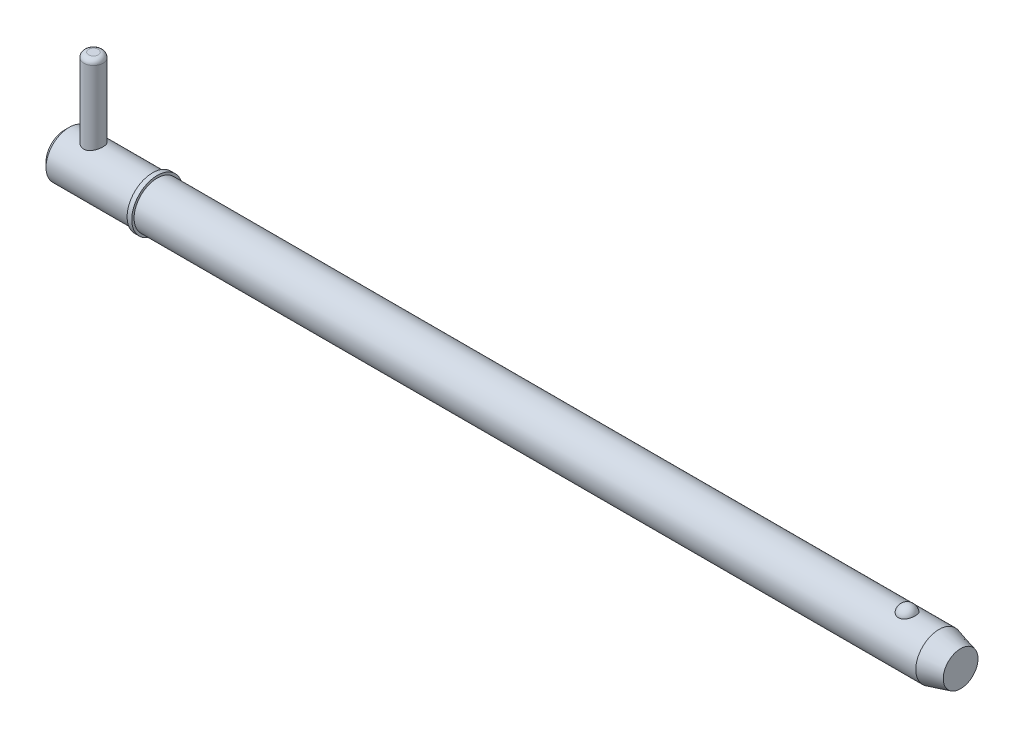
ISO-10303-21;
HEADER;
FILE_DESCRIPTION(('STEP AP214'),'2;1');
FILE_NAME('part.step','',(''),(''),'','','');
FILE_SCHEMA(('AUTOMOTIVE_DESIGN { 1 0 10303 214 1 1 1 1 }'));
ENDSEC;
DATA;
#1=APPLICATION_CONTEXT('core data for automotive mechanical design processes');
#2=APPLICATION_PROTOCOL_DEFINITION('international standard','automotive_design',2000,#1);
#3=PRODUCT_CONTEXT('',#1,'mechanical');
#4=PRODUCT('Part','Part','',(#3));
#5=PRODUCT_RELATED_PRODUCT_CATEGORY('part','',(#4));
#6=PRODUCT_DEFINITION_FORMATION('','',#4);
#7=PRODUCT_DEFINITION_CONTEXT('part definition',#1,'design');
#8=PRODUCT_DEFINITION('design','',#6,#7);
#9=PRODUCT_DEFINITION_SHAPE('','',#8);
#10=(LENGTH_UNIT() NAMED_UNIT(*) SI_UNIT(.MILLI.,.METRE.));
#11=(NAMED_UNIT(*) PLANE_ANGLE_UNIT() SI_UNIT($,.RADIAN.));
#12=(NAMED_UNIT(*) SI_UNIT($,.STERADIAN.) SOLID_ANGLE_UNIT());
#13=UNCERTAINTY_MEASURE_WITH_UNIT(LENGTH_MEASURE(1.E-05),#10,'distance_accuracy_value','');
#14=(GEOMETRIC_REPRESENTATION_CONTEXT(3) GLOBAL_UNCERTAINTY_ASSIGNED_CONTEXT((#13)) GLOBAL_UNIT_ASSIGNED_CONTEXT((#10,
#11,#12)) REPRESENTATION_CONTEXT('',''));
#15=CARTESIAN_POINT('',(0.,0.,0.));
#16=DIRECTION('',(0.,0.,1.));
#17=DIRECTION('',(1.,0.,0.));
#18=AXIS2_PLACEMENT_3D('',#15,#16,#17);
#19=CARTESIAN_POINT('',(5.94,20.635,0.));
#20=DIRECTION('',(0.,-1.,0.));
#21=DIRECTION('',(0.,0.,-1.));
#22=AXIS2_PLACEMENT_3D('',#19,#20,#21);
#23=CYLINDRICAL_SURFACE('',#22,1.98);
#24=CARTESIAN_POINT('',(5.94,-3.775,0.));
#25=DIRECTION('',(0.,1.,0.));
#26=DIRECTION('',(0.,0.,1.));
#27=AXIS2_PLACEMENT_3D('',#24,#25,#26);
#28=CIRCLE('',#27,1.98);
#29=CARTESIAN_POINT('',(5.94,-3.775,1.98));
#30=VERTEX_POINT('',#29);
#31=EDGE_CURVE('P0_E25',#30,#30,#28,.T.);
#32=ORIENTED_EDGE('',*,*,#31,.T.);
#33=EDGE_LOOP('',(#32));
#34=FACE_BOUND('',#33,.T.);
#35=CARTESIAN_POINT('',(5.94,19.645,0.));
#36=DIRECTION('',(0.,1.,0.));
#37=DIRECTION('',(0.,0.,1.));
#38=AXIS2_PLACEMENT_3D('',#35,#36,#37);
#39=CIRCLE('',#38,1.98);
#40=CARTESIAN_POINT('',(5.94,19.645,1.98));
#41=VERTEX_POINT('',#40);
#42=EDGE_CURVE('P0_E29',#41,#41,#39,.F.);
#43=ORIENTED_EDGE('',*,*,#42,.T.);
#44=EDGE_LOOP('',(#43));
#45=FACE_BOUND('',#44,.T.);
#46=ADVANCED_FACE('P0_F14',(#34,#45),#23,.T.);
#47=CARTESIAN_POINT('',(5.94,20.635,0.));
#48=DIRECTION('',(0.,1.,0.));
#49=DIRECTION('',(0.,0.,1.));
#50=AXIS2_PLACEMENT_3D('',#47,#48,#49);
#51=PLANE('',#50);
#52=CARTESIAN_POINT('',(5.94,20.635,0.));
#53=DIRECTION('',(0.,1.,0.));
#54=DIRECTION('',(0.,0.,1.));
#55=AXIS2_PLACEMENT_3D('',#52,#53,#54);
#56=CIRCLE('',#55,0.99);
#57=CARTESIAN_POINT('',(5.94,20.635,0.99));
#58=VERTEX_POINT('',#57);
#59=EDGE_CURVE('P0_E10',#58,#58,#56,.T.);
#60=ORIENTED_EDGE('',*,*,#59,.T.);
#61=EDGE_LOOP('',(#60));
#62=FACE_BOUND('',#61,.T.);
#63=ADVANCED_FACE('P0_F46',(#62),#51,.T.);
#64=CARTESIAN_POINT('',(5.94,-4.765,0.));
#65=DIRECTION('',(0.,1.,0.));
#66=DIRECTION('',(0.,0.,1.));
#67=AXIS2_PLACEMENT_3D('',#64,#65,#66);
#68=PLANE('',#67);
#69=CARTESIAN_POINT('',(5.94,-4.765,0.));
#70=DIRECTION('',(0.,1.,0.));
#71=DIRECTION('',(0.,0.,1.));
#72=AXIS2_PLACEMENT_3D('',#69,#70,#71);
#73=CIRCLE('',#72,0.99);
#74=CARTESIAN_POINT('',(5.94,-4.765,0.99));
#75=VERTEX_POINT('',#74);
#76=EDGE_CURVE('P0_E21',#75,#75,#73,.F.);
#77=ORIENTED_EDGE('',*,*,#76,.T.);
#78=EDGE_LOOP('',(#77));
#79=FACE_BOUND('',#78,.T.);
#80=ADVANCED_FACE('P0_F43',(#79),#68,.F.);
#81=CARTESIAN_POINT('',(5.94,-3.775,0.));
#82=DIRECTION('',(0.,1.,0.));
#83=DIRECTION('',(0.,0.,1.));
#84=AXIS2_PLACEMENT_3D('',#81,#82,#83);
#85=DEGENERATE_TOROIDAL_SURFACE('',#84,0.99,0.99,.T.);
#86=ORIENTED_EDGE('',*,*,#76,.F.);
#87=EDGE_LOOP('',(#86));
#88=FACE_BOUND('',#87,.T.);
#89=ORIENTED_EDGE('',*,*,#31,.F.);
#90=EDGE_LOOP('',(#89));
#91=FACE_BOUND('',#90,.T.);
#92=ADVANCED_FACE('P0_F38',(#88,#91),#85,.T.);
#93=CARTESIAN_POINT('',(5.94,19.645,0.));
#94=DIRECTION('',(0.,1.,0.));
#95=DIRECTION('',(0.,0.,1.));
#96=AXIS2_PLACEMENT_3D('',#93,#94,#95);
#97=DEGENERATE_TOROIDAL_SURFACE('',#96,0.99,0.99,.T.);
#98=ORIENTED_EDGE('',*,*,#42,.F.);
#99=EDGE_LOOP('',(#98));
#100=FACE_BOUND('',#99,.T.);
#101=ORIENTED_EDGE('',*,*,#59,.F.);
#102=EDGE_LOOP('',(#101));
#103=FACE_BOUND('',#102,.T.);
#104=ADVANCED_FACE('P0_F16',(#100,#103),#97,.T.);
#105=CLOSED_SHELL('',(#46,#63,#80,#92,#104));
#106=MANIFOLD_SOLID_BREP('P0_B1',#105);
#107=CARTESIAN_POINT('',(0.,0.,0.));
#108=DIRECTION('',(1.,0.,0.));
#109=DIRECTION('',(0.,0.,-1.));
#110=AXIS2_PLACEMENT_3D('',#107,#108,#109);
#111=CYLINDRICAL_SURFACE('',#110,4.765);
#112=CARTESIAN_POINT('',(179.704194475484,0.,0.));
#113=DIRECTION('',(1.,0.,0.));
#114=DIRECTION('',(0.,0.,-1.));
#115=AXIS2_PLACEMENT_3D('',#112,#113,#114);
#116=CIRCLE('',#115,4.765);
#117=CARTESIAN_POINT('',(179.704194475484,0.,-4.765));
#118=VERTEX_POINT('',#117);
#119=EDGE_CURVE('P1_E81',#118,#118,#116,.T.);
#120=ORIENTED_EDGE('',*,*,#119,.F.);
#121=EDGE_LOOP('',(#120));
#122=FACE_BOUND('',#121,.T.);
#123=CARTESIAN_POINT('',(19.05,0.,0.));
#124=DIRECTION('',(1.,0.,0.));
#125=DIRECTION('',(0.,0.,-1.));
#126=AXIS2_PLACEMENT_3D('',#123,#124,#125);
#127=CIRCLE('',#126,4.765);
#128=CARTESIAN_POINT('',(19.05,0.,-4.765));
#129=VERTEX_POINT('',#128);
#130=EDGE_CURVE('P1_E85',#129,#129,#127,.T.);
#131=ORIENTED_EDGE('',*,*,#130,.T.);
#132=EDGE_LOOP('',(#131));
#133=FACE_BOUND('',#132,.T.);
#134=CARTESIAN_POINT('',(173.151020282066,4.42764777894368,1.76101111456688));
#135=CARTESIAN_POINT('',(173.059721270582,4.42764470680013,1.76101422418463));
#136=CARTESIAN_POINT('',(172.968446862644,4.43059091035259,1.75366340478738));
#137=CARTESIAN_POINT('',(172.788615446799,4.44201846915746,1.72451180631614));
#138=CARTESIAN_POINT('',(172.700057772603,4.45049845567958,1.70271460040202));
#139=CARTESIAN_POINT('',(172.528257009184,4.47200516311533,1.64539370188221));
#140=CARTESIAN_POINT('',(172.445006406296,4.48502527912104,1.60988994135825));
#141=CARTESIAN_POINT('',(172.285763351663,4.51419542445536,1.52617873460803));
#142=CARTESIAN_POINT('',(172.209772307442,4.53034605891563,1.47796883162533));
#143=CARTESIAN_POINT('',(172.064744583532,4.56459317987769,1.36860494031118));
#144=CARTESIAN_POINT('',(171.995964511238,4.58273170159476,1.30712420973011));
#145=CARTESIAN_POINT('',(171.869342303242,4.61870302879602,1.17370204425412));
#146=CARTESIAN_POINT('',(171.811502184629,4.63653577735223,1.10175868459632));
#147=CARTESIAN_POINT('',(171.705570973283,4.67090140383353,0.945806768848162));
#148=CARTESIAN_POINT('',(171.658030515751,4.68734068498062,0.861402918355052));
#149=CARTESIAN_POINT('',(171.577081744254,4.71628466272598,0.685442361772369));
#150=CARTESIAN_POINT('',(171.543674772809,4.72878898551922,0.593884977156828));
#151=CARTESIAN_POINT('',(171.491287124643,4.74874061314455,0.404781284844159));
#152=CARTESIAN_POINT('',(171.472517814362,4.75611366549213,0.307168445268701));
#153=CARTESIAN_POINT('',(171.450584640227,4.76475393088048,0.109940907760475));
#154=CARTESIAN_POINT('',(171.447420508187,4.76602124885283,0.0103262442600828));
#155=CARTESIAN_POINT('',(171.456740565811,4.76232928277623,-0.187629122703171));
#156=CARTESIAN_POINT('',(171.469158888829,4.7573962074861,-0.285973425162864));
#157=CARTESIAN_POINT('',(171.509280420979,4.74184975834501,-0.479027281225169));
#158=CARTESIAN_POINT('',(171.536983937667,4.7312362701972,-0.573736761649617));
#159=CARTESIAN_POINT('',(171.607158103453,4.70540026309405,-0.756973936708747));
#160=CARTESIAN_POINT('',(171.649646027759,4.69017235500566,-0.845494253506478));
#161=CARTESIAN_POINT('',(171.748520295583,4.65669867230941,-1.01378033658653));
#162=CARTESIAN_POINT('',(171.804907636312,4.63845268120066,-1.09354547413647));
#163=CARTESIAN_POINT('',(171.930552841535,4.60085438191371,-1.24228523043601));
#164=CARTESIAN_POINT('',(171.999843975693,4.58149930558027,-1.31123108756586));
#165=CARTESIAN_POINT('',(172.149606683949,4.54391653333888,-1.43607409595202));
#166=CARTESIAN_POINT('',(172.230077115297,4.52568872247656,-1.49197257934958));
#167=CARTESIAN_POINT('',(172.398150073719,4.49293007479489,-1.58786764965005));
#168=CARTESIAN_POINT('',(172.485544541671,4.47832346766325,-1.62820219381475));
#169=CARTESIAN_POINT('',(172.666553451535,4.45406011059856,-1.69345757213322));
#170=CARTESIAN_POINT('',(172.76016555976,4.44440151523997,-1.71838415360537));
#171=CARTESIAN_POINT('',(172.945893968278,4.43159888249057,-1.75112843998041));
#172=CARTESIAN_POINT('',(173.037849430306,4.42815213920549,-1.75974223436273));
#173=CARTESIAN_POINT('',(173.221965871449,4.427247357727,-1.76201865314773));
#174=CARTESIAN_POINT('',(173.314126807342,4.42978816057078,-1.7556841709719));
#175=CARTESIAN_POINT('',(173.493129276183,4.44038648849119,-1.72869560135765));
#176=CARTESIAN_POINT('',(173.580047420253,4.44827555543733,-1.70847853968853));
#177=CARTESIAN_POINT('',(173.749131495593,4.46852246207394,-1.65479562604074));
#178=CARTESIAN_POINT('',(173.831297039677,4.48088066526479,-1.62132869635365));
#179=CARTESIAN_POINT('',(173.990591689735,4.50907357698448,-1.54120560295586));
#180=CARTESIAN_POINT('',(174.067570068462,4.52497884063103,-1.49427526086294));
#181=CARTESIAN_POINT('',(174.212708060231,4.55845148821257,-1.38881222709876));
#182=CARTESIAN_POINT('',(174.280865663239,4.57601924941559,-1.33027689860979));
#183=CARTESIAN_POINT('',(174.410099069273,4.61196537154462,-1.1999104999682));
#184=CARTESIAN_POINT('',(174.470656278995,4.63034074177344,-1.12756415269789));
#185=CARTESIAN_POINT('',(174.579279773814,4.66513959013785,-0.97361299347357));
#186=CARTESIAN_POINT('',(174.627343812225,4.68156271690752,-0.892006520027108));
#187=CARTESIAN_POINT('',(174.711383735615,4.71130224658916,-0.718892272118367));
#188=CARTESIAN_POINT('',(174.746918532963,4.724501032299,-0.627149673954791));
#189=CARTESIAN_POINT('',(174.802952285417,4.74571823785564,-0.438611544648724));
#190=CARTESIAN_POINT('',(174.823450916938,4.75373654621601,-0.34181590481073));
#191=CARTESIAN_POINT('',(174.849033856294,4.76378905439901,-0.145633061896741));
#192=CARTESIAN_POINT('',(174.854076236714,4.76580697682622,-0.0462395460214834));
#193=CARTESIAN_POINT('',(174.848523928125,4.7636057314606,0.152038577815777));
#194=CARTESIAN_POINT('',(174.837929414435,4.75938663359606,0.250923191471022));
#195=CARTESIAN_POINT('',(174.801387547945,4.74516937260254,0.445004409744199));
#196=CARTESIAN_POINT('',(174.775496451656,4.73519238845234,0.540213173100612));
#197=CARTESIAN_POINT('',(174.708927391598,4.71049394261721,0.724662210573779));
#198=CARTESIAN_POINT('',(174.668248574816,4.69577220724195,0.813902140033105));
#199=CARTESIAN_POINT('',(174.572717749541,4.66303767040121,0.984313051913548));
#200=CARTESIAN_POINT('',(174.517804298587,4.64501070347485,1.06544688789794));
#201=CARTESIAN_POINT('',(174.395049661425,4.60764678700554,1.21692673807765));
#202=CARTESIAN_POINT('',(174.327208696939,4.58830985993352,1.28727293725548));
#203=CARTESIAN_POINT('',(174.180548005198,4.55060370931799,1.41479271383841));
#204=CARTESIAN_POINT('',(174.101791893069,4.53222967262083,1.47203785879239));
#205=CARTESIAN_POINT('',(173.934989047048,4.49849576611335,1.57212016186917));
#206=CARTESIAN_POINT('',(173.846941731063,4.48313608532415,1.6149564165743));
#207=CARTESIAN_POINT('',(173.659791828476,4.45676184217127,1.68642657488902));
#208=CARTESIAN_POINT('',(173.560365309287,4.44598302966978,1.71430590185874));
#209=CARTESIAN_POINT('',(173.357621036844,4.43142918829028,1.7515925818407));
#210=CARTESIAN_POINT('',(173.254304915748,4.42765125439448,1.76100759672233));
#211=CARTESIAN_POINT('',(173.151020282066,4.42764777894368,1.76101111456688));
#212=B_SPLINE_CURVE_WITH_KNOTS('',3,(#134,#135,#136,#137,#138,#139,#140,#141,#142,#143,#144,
#145,#146,#147,#148,#149,#150,#151,#152,#153,#154,#155,#156,#157,#158,#159,#160,#161,#162,#163,
#164,#165,#166,#167,#168,#169,#170,#171,#172,#173,#174,#175,#176,#177,#178,#179,#180,#181,#182,
#183,#184,#185,#186,#187,#188,#189,#190,#191,#192,#193,#194,#195,#196,#197,#198,#199,#200,#201,
#202,#203,#204,#205,#206,#207,#208,#209,#210,#211),.UNSPECIFIED.,.T.,.F.,(4,2,2,2,2,2,2,2,2,2,2,
2,2,2,2,2,2,2,2,2,2,2,2,2,2,2,2,2,2,2,2,2,2,2,2,2,2,2,4),(0.,0.273517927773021,
0.546968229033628,0.820022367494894,1.09312934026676,1.37393946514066,1.6548013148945,
1.94820420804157,2.24163496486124,2.53922817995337,2.83681628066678,3.13315071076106,
3.42949110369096,3.72617893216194,4.02288805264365,4.32037303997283,4.61782764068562,
4.90840095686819,5.19886582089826,5.47474855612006,5.75057789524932,6.0180997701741,
6.28564340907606,6.55907787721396,6.83257454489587,7.11962987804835,7.40673679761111,
7.70312663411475,7.9995228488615,8.29672237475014,8.59391856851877,8.89002850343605,
9.18615552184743,9.48358266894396,9.7810047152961,10.0767610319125,10.3725358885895,
10.6820893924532,10.991514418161),.UNSPECIFIED.);
#213=CARTESIAN_POINT('',(173.151020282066,4.42764777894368,1.76101111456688));
#214=VERTEX_POINT('',#213);
#215=EDGE_CURVE('P1_E35',#214,#214,#212,.T.);
#216=ORIENTED_EDGE('',*,*,#215,.T.);
#217=EDGE_LOOP('',(#216));
#218=FACE_BOUND('',#217,.T.);
#219=ADVANCED_FACE('P1_F13',(#122,#133,#218),#111,.T.);
#220=CARTESIAN_POINT('',(0.,0.,0.));
#221=DIRECTION('',(-1.,0.,0.));
#222=DIRECTION('',(0.,0.,1.));
#223=AXIS2_PLACEMENT_3D('',#220,#221,#222);
#224=PLANE('',#223);
#225=CARTESIAN_POINT('',(0.,0.,0.));
#226=DIRECTION('',(1.,0.,0.));
#227=DIRECTION('',(0.,0.,-1.));
#228=AXIS2_PLACEMENT_3D('',#225,#226,#227);
#229=CIRCLE('',#228,3.812);
#230=CARTESIAN_POINT('',(0.,0.,-3.812));
#231=VERTEX_POINT('',#230);
#232=EDGE_CURVE('P1_E9',#231,#231,#229,.T.);
#233=ORIENTED_EDGE('',*,*,#232,.F.);
#234=EDGE_LOOP('',(#233));
#235=FACE_BOUND('',#234,.T.);
#236=ADVANCED_FACE('P1_F15',(#235),#224,.T.);
#237=CARTESIAN_POINT('',(0.952999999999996,0.,0.));
#238=DIRECTION('',(1.,0.,0.));
#239=DIRECTION('',(0.,0.,-1.));
#240=AXIS2_PLACEMENT_3D('',#237,#238,#239);
#241=CONICAL_SURFACE('',#240,4.765,0.78539816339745);
#242=ORIENTED_EDGE('',*,*,#232,.T.);
#243=EDGE_LOOP('',(#242));
#244=FACE_BOUND('',#243,.T.);
#245=CARTESIAN_POINT('',(0.952999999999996,0.,0.));
#246=DIRECTION('',(1.,0.,0.));
#247=DIRECTION('',(0.,0.,-1.));
#248=AXIS2_PLACEMENT_3D('',#245,#246,#247);
#249=CIRCLE('',#248,4.765);
#250=CARTESIAN_POINT('',(0.952999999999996,0.,-4.765));
#251=VERTEX_POINT('',#250);
#252=EDGE_CURVE('P1_E26',#251,#251,#249,.T.);
#253=ORIENTED_EDGE('',*,*,#252,.F.);
#254=EDGE_LOOP('',(#253));
#255=FACE_BOUND('',#254,.T.);
#256=ADVANCED_FACE('P1_F77',(#244,#255),#241,.T.);
#257=CARTESIAN_POINT('',(0.,0.,0.));
#258=DIRECTION('',(1.,0.,0.));
#259=DIRECTION('',(0.,0.,-1.));
#260=AXIS2_PLACEMENT_3D('',#257,#258,#259);
#261=CYLINDRICAL_SURFACE('',#260,4.765);
#262=CARTESIAN_POINT('',(5.94,-4.33414639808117,1.98));
#263=CARTESIAN_POINT('',(5.83435484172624,-4.33415447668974,1.97999169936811));
#264=CARTESIAN_POINT('',(5.72854887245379,-4.33806396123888,1.97149330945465));
#265=CARTESIAN_POINT('',(5.51998191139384,-4.35319906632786,1.93783487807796));
#266=CARTESIAN_POINT('',(5.41723000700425,-4.3644446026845,1.91262947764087));
#267=CARTESIAN_POINT('',(5.21817294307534,-4.39274225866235,1.84670269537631));
#268=CARTESIAN_POINT('',(5.12184344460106,-4.40977076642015,1.80604432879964));
#269=CARTESIAN_POINT('',(4.93740039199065,-4.44768106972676,1.71055160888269));
#270=CARTESIAN_POINT('',(4.84928487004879,-4.46856193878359,1.65572066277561));
#271=CARTESIAN_POINT('',(4.67826533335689,-4.51326966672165,1.52981120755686));
#272=CARTESIAN_POINT('',(4.59593118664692,-4.53719608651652,1.45799365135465));
#273=CARTESIAN_POINT('',(4.44405452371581,-4.58448035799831,1.30170177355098));
#274=CARTESIAN_POINT('',(4.37451692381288,-4.60783798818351,1.21722260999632));
#275=CARTESIAN_POINT('',(4.24730683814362,-4.65256187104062,1.03353484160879));
#276=CARTESIAN_POINT('',(4.19027484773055,-4.67379892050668,0.933848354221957));
#277=CARTESIAN_POINT('',(4.0940363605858,-4.7106711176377,0.7252544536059));
#278=CARTESIAN_POINT('',(4.05482199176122,-4.72630873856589,0.61635113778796));
#279=CARTESIAN_POINT('',(3.99739515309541,-4.74951416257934,0.398397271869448));
#280=CARTESIAN_POINT('',(3.97820018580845,-4.7574579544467,0.289646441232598));
#281=CARTESIAN_POINT('',(3.95818309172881,-4.76574596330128,0.0701967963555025));
#282=CARTESIAN_POINT('',(3.95735355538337,-4.76609324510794,-0.0405012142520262));
#283=CARTESIAN_POINT('',(3.9735743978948,-4.75937098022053,-0.253561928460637));
#284=CARTESIAN_POINT('',(3.98954548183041,-4.75274912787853,-0.356023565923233));
#285=CARTESIAN_POINT('',(4.03706504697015,-4.73344665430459,-0.556659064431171));
#286=CARTESIAN_POINT('',(4.06861467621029,-4.72076558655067,-0.654832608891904));
#287=CARTESIAN_POINT('',(4.14677192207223,-4.69032846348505,-0.845904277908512));
#288=CARTESIAN_POINT('',(4.19360181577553,-4.67249797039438,-0.938699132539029));
#289=CARTESIAN_POINT('',(4.30077315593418,-4.63350852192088,-1.11535616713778));
#290=CARTESIAN_POINT('',(4.3611193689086,-4.61234839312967,-1.19921518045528));
#291=CARTESIAN_POINT('',(4.49853487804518,-4.56707259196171,-1.3618711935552));
#292=CARTESIAN_POINT('',(4.57648039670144,-4.5428537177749,-1.43990029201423));
#293=CARTESIAN_POINT('',(4.74440779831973,-4.49530722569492,-1.58211009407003));
#294=CARTESIAN_POINT('',(4.83439425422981,-4.47197995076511,-1.64628551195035));
#295=CARTESIAN_POINT('',(5.02755026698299,-4.42812342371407,-1.76092221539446));
#296=CARTESIAN_POINT('',(5.13105348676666,-4.40770990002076,-1.81086937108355));
#297=CARTESIAN_POINT('',(5.34607555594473,-4.37336901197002,-1.89231211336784));
#298=CARTESIAN_POINT('',(5.45758864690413,-4.3594370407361,-1.92382080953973));
#299=CARTESIAN_POINT('',(5.67777275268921,-4.34077746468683,-1.96554536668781));
#300=CARTESIAN_POINT('',(5.78616167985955,-4.33551319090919,-1.9770057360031));
#301=CARTESIAN_POINT('',(6.00341835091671,-4.33325118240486,-1.98196183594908));
#302=CARTESIAN_POINT('',(6.11228591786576,-4.33625061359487,-1.97546372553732));
#303=CARTESIAN_POINT('',(6.32012423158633,-4.34962383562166,-1.94582288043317));
#304=CARTESIAN_POINT('',(6.41928436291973,-4.35951709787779,-1.92376364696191));
#305=CARTESIAN_POINT('',(6.61241543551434,-4.38495043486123,-1.86506038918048));
#306=CARTESIAN_POINT('',(6.70638516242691,-4.40049182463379,-1.82841296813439));
#307=CARTESIAN_POINT('',(6.89090272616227,-4.43627016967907,-1.73985559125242));
#308=CARTESIAN_POINT('',(6.98113841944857,-4.45667771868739,-1.68736639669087));
#309=CARTESIAN_POINT('',(7.1519532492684,-4.49964530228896,-1.56919282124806));
#310=CARTESIAN_POINT('',(7.232528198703,-4.52220626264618,-1.50350275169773));
#311=CARTESIAN_POINT('',(7.38851617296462,-4.56914071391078,-1.35452895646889));
#312=CARTESIAN_POINT('',(7.46298462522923,-4.5935132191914,-1.27025197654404));
#313=CARTESIAN_POINT('',(7.59689029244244,-4.63962841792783,-1.08983181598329));
#314=CARTESIAN_POINT('',(7.65632644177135,-4.66137092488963,-0.993687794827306));
#315=CARTESIAN_POINT('',(7.75840361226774,-4.69991192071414,-0.791608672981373));
#316=CARTESIAN_POINT('',(7.80100481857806,-4.71669866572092,-0.685651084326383));
#317=CARTESIAN_POINT('',(7.86746997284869,-4.74331408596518,-0.467197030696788));
#318=CARTESIAN_POINT('',(7.8913450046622,-4.75314687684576,-0.354704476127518));
#319=CARTESIAN_POINT('',(7.91828971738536,-4.76427543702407,-0.134819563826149));
#320=CARTESIAN_POINT('',(7.92269147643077,-4.76611762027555,-0.027616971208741));
#321=CARTESIAN_POINT('',(7.91414154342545,-4.76256684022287,0.185959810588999));
#322=CARTESIAN_POINT('',(7.90119286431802,-4.75717513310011,0.292334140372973));
#323=CARTESIAN_POINT('',(7.85926572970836,-4.74004856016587,0.497383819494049));
#324=CARTESIAN_POINT('',(7.83086647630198,-4.72854322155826,0.596198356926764));
#325=CARTESIAN_POINT('',(7.75947503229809,-4.70045111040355,0.787624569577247));
#326=CARTESIAN_POINT('',(7.71648006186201,-4.68386336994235,0.880235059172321));
#327=CARTESIAN_POINT('',(7.6149456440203,-4.64628321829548,1.06122875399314));
#328=CARTESIAN_POINT('',(7.55579211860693,-4.62512577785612,1.14923242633));
#329=CARTESIAN_POINT('',(7.42451813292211,-4.58091700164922,1.31443888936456));
#330=CARTESIAN_POINT('',(7.35239289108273,-4.5578649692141,1.39163767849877));
#331=CARTESIAN_POINT('',(7.19146107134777,-4.51050832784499,1.53847013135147));
#332=CARTESIAN_POINT('',(7.10185635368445,-4.48622440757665,1.60723941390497));
#333=CARTESIAN_POINT('',(6.91164948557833,-4.44076541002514,1.72888900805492));
#334=CARTESIAN_POINT('',(6.81104124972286,-4.41959206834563,1.78176046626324));
#335=CARTESIAN_POINT('',(6.60181953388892,-4.38318936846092,1.86953227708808));
#336=CARTESIAN_POINT('',(6.49325511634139,-4.3679267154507,1.90453365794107));
#337=CARTESIAN_POINT('',(6.32681512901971,-4.35102038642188,1.94268459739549));
#338=CARTESIAN_POINT('',(6.27079191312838,-4.34638447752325,1.953006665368));
#339=CARTESIAN_POINT('',(6.15793999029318,-4.33925923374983,1.96879053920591));
#340=CARTESIAN_POINT('',(6.10111188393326,-4.33676837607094,1.97425579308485));
#341=CARTESIAN_POINT('',(6.00947316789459,-4.33456308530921,1.97908711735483));
#342=CARTESIAN_POINT('',(5.97474528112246,-4.33414374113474,1.98000272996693));
#343=CARTESIAN_POINT('',(5.94,-4.33414639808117,1.98));
#344=B_SPLINE_CURVE_WITH_KNOTS('',3,(#262,#263,#264,#265,#266,#267,#268,#269,#270,#271,#272,
#273,#274,#275,#276,#277,#278,#279,#280,#281,#282,#283,#284,#285,#286,#287,#288,#289,#290,#291,
#292,#293,#294,#295,#296,#297,#298,#299,#300,#301,#302,#303,#304,#305,#306,#307,#308,#309,#310,
#311,#312,#313,#314,#315,#316,#317,#318,#319,#320,#321,#322,#323,#324,#325,#326,#327,#328,#329,
#330,#331,#332,#333,#334,#335,#336,#337,#338,#339,#340,#341,#342,#343),.UNSPECIFIED.,.T.,.F.,(4,
2,2,2,2,2,2,2,2,2,2,2,2,2,2,2,2,2,2,2,2,2,2,2,2,2,2,2,2,2,2,2,2,2,2,2,2,2,2,2,4),(0.,
0.316814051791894,0.634491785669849,0.950887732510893,1.2672076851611,1.60127705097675,
1.93547449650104,2.28407463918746,2.63252061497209,2.96292077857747,3.29318763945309,
3.60346227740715,3.91375978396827,4.22878888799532,4.54392926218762,4.88117914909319,
5.21855748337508,5.56691259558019,5.91501972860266,6.24062939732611,6.56612741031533,
6.87094948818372,7.17584258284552,7.49361276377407,7.81152017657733,8.15513975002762,
8.4987836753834,8.8432355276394,9.18748334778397,9.50777781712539,9.8280166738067,
10.1370037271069,10.4460496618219,10.7690461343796,11.0921619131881,11.4371238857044,
11.7822776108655,12.1254577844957,12.2967183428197,12.4678572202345,12.5720531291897),.UNSPECIFIED.);
#345=CARTESIAN_POINT('',(5.94,-4.33414639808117,1.98));
#346=VERTEX_POINT('',#345);
#347=EDGE_CURVE('P1_E17',#346,#346,#344,.T.);
#348=ORIENTED_EDGE('',*,*,#347,.F.);
#349=EDGE_LOOP('',(#348));
#350=FACE_BOUND('',#349,.T.);
#351=CARTESIAN_POINT('',(5.94,4.33414639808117,1.98));
#352=CARTESIAN_POINT('',(6.04564515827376,4.33415447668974,1.97999169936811));
#353=CARTESIAN_POINT('',(6.15145112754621,4.33806396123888,1.97149330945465));
#354=CARTESIAN_POINT('',(6.36001808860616,4.35319906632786,1.93783487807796));
#355=CARTESIAN_POINT('',(6.46276999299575,4.3644446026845,1.91262947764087));
#356=CARTESIAN_POINT('',(6.66182705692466,4.39274225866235,1.84670269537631));
#357=CARTESIAN_POINT('',(6.75815655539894,4.40977076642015,1.80604432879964));
#358=CARTESIAN_POINT('',(6.94259960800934,4.44768106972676,1.71055160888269));
#359=CARTESIAN_POINT('',(7.03071512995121,4.46856193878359,1.65572066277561));
#360=CARTESIAN_POINT('',(7.20173466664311,4.51326966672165,1.52981120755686));
#361=CARTESIAN_POINT('',(7.28406881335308,4.53719608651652,1.45799365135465));
#362=CARTESIAN_POINT('',(7.43594547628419,4.58448035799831,1.30170177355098));
#363=CARTESIAN_POINT('',(7.50548307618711,4.60783798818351,1.21722260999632));
#364=CARTESIAN_POINT('',(7.63269316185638,4.65256187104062,1.03353484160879));
#365=CARTESIAN_POINT('',(7.68972515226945,4.67379892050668,0.933848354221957));
#366=CARTESIAN_POINT('',(7.7859636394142,4.7106711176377,0.7252544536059));
#367=CARTESIAN_POINT('',(7.82517800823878,4.72630873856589,0.61635113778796));
#368=CARTESIAN_POINT('',(7.88260484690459,4.74951416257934,0.398397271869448));
#369=CARTESIAN_POINT('',(7.90179981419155,4.7574579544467,0.289646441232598));
#370=CARTESIAN_POINT('',(7.92181690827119,4.76574596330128,0.0701967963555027));
#371=CARTESIAN_POINT('',(7.92264644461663,4.76609324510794,-0.040501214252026));
#372=CARTESIAN_POINT('',(7.9064256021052,4.75937098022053,-0.253561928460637));
#373=CARTESIAN_POINT('',(7.89045451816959,4.75274912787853,-0.356023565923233));
#374=CARTESIAN_POINT('',(7.84293495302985,4.73344665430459,-0.55665906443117));
#375=CARTESIAN_POINT('',(7.81138532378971,4.72076558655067,-0.654832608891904));
#376=CARTESIAN_POINT('',(7.73322807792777,4.69032846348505,-0.845904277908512));
#377=CARTESIAN_POINT('',(7.68639818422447,4.67249797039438,-0.938699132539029));
#378=CARTESIAN_POINT('',(7.57922684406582,4.63350852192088,-1.11535616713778));
#379=CARTESIAN_POINT('',(7.5188806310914,4.61234839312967,-1.19921518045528));
#380=CARTESIAN_POINT('',(7.38146512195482,4.56707259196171,-1.3618711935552));
#381=CARTESIAN_POINT('',(7.30351960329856,4.5428537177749,-1.43990029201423));
#382=CARTESIAN_POINT('',(7.13559220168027,4.49530722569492,-1.58211009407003));
#383=CARTESIAN_POINT('',(7.04560574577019,4.47197995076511,-1.64628551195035));
#384=CARTESIAN_POINT('',(6.85244973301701,4.42812342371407,-1.76092221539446));
#385=CARTESIAN_POINT('',(6.74894651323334,4.40770990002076,-1.81086937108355));
#386=CARTESIAN_POINT('',(6.53392444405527,4.37336901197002,-1.89231211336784));
#387=CARTESIAN_POINT('',(6.42241135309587,4.3594370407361,-1.92382080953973));
#388=CARTESIAN_POINT('',(6.20222724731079,4.34077746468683,-1.96554536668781));
#389=CARTESIAN_POINT('',(6.09383832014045,4.33551319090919,-1.9770057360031));
#390=CARTESIAN_POINT('',(5.87658164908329,4.33325118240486,-1.98196183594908));
#391=CARTESIAN_POINT('',(5.76771408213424,4.33625061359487,-1.97546372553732));
#392=CARTESIAN_POINT('',(5.55987576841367,4.34962383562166,-1.94582288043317));
#393=CARTESIAN_POINT('',(5.46071563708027,4.35951709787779,-1.92376364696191));
#394=CARTESIAN_POINT('',(5.26758456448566,4.38495043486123,-1.86506038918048));
#395=CARTESIAN_POINT('',(5.17361483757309,4.40049182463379,-1.82841296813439));
#396=CARTESIAN_POINT('',(4.98909727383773,4.43627016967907,-1.73985559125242));
#397=CARTESIAN_POINT('',(4.89886158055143,4.45667771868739,-1.68736639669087));
#398=CARTESIAN_POINT('',(4.72804675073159,4.49964530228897,-1.56919282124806));
#399=CARTESIAN_POINT('',(4.647471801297,4.52220626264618,-1.50350275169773));
#400=CARTESIAN_POINT('',(4.49148382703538,4.56914071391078,-1.35452895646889));
#401=CARTESIAN_POINT('',(4.41701537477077,4.5935132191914,-1.27025197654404));
#402=CARTESIAN_POINT('',(4.28310970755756,4.63962841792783,-1.08983181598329));
#403=CARTESIAN_POINT('',(4.22367355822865,4.66137092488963,-0.993687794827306));
#404=CARTESIAN_POINT('',(4.12159638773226,4.69991192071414,-0.791608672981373));
#405=CARTESIAN_POINT('',(4.07899518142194,4.71669866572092,-0.685651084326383));
#406=CARTESIAN_POINT('',(4.01253002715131,4.74331408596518,-0.467197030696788));
#407=CARTESIAN_POINT('',(3.98865499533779,4.75314687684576,-0.354704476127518));
#408=CARTESIAN_POINT('',(3.96171028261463,4.76427543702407,-0.134819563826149));
#409=CARTESIAN_POINT('',(3.95730852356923,4.76611762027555,-0.0276169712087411));
#410=CARTESIAN_POINT('',(3.96585845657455,4.76256684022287,0.185959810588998));
#411=CARTESIAN_POINT('',(3.97880713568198,4.75717513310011,0.292334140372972));
#412=CARTESIAN_POINT('',(4.02073427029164,4.74004856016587,0.497383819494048));
#413=CARTESIAN_POINT('',(4.04913352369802,4.72854322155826,0.596198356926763));
#414=CARTESIAN_POINT('',(4.12052496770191,4.70045111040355,0.787624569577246));
#415=CARTESIAN_POINT('',(4.16351993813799,4.68386336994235,0.880235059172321));
#416=CARTESIAN_POINT('',(4.2650543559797,4.64628321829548,1.06122875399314));
#417=CARTESIAN_POINT('',(4.32420788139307,4.62512577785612,1.14923242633));
#418=CARTESIAN_POINT('',(4.45548186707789,4.58091700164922,1.31443888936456));
#419=CARTESIAN_POINT('',(4.52760710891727,4.5578649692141,1.39163767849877));
#420=CARTESIAN_POINT('',(4.68853892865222,4.51050832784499,1.53847013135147));
#421=CARTESIAN_POINT('',(4.77814364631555,4.48622440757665,1.60723941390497));
#422=CARTESIAN_POINT('',(4.96835051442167,4.44076541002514,1.72888900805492));
#423=CARTESIAN_POINT('',(5.06895875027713,4.41959206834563,1.78176046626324));
#424=CARTESIAN_POINT('',(5.27818046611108,4.38318936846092,1.86953227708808));
#425=CARTESIAN_POINT('',(5.38674488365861,4.3679267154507,1.90453365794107));
#426=CARTESIAN_POINT('',(5.55318487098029,4.35102038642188,1.94268459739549));
#427=CARTESIAN_POINT('',(5.60920808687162,4.34638447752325,1.953006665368));
#428=CARTESIAN_POINT('',(5.72206000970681,4.33925923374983,1.96879053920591));
#429=CARTESIAN_POINT('',(5.77888811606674,4.33676837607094,1.97425579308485));
#430=CARTESIAN_POINT('',(5.87052683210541,4.33456308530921,1.97908711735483));
#431=CARTESIAN_POINT('',(5.90525471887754,4.33414374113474,1.98000272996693));
#432=CARTESIAN_POINT('',(5.94,4.33414639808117,1.98));
#433=B_SPLINE_CURVE_WITH_KNOTS('',3,(#351,#352,#353,#354,#355,#356,#357,#358,#359,#360,#361,
#362,#363,#364,#365,#366,#367,#368,#369,#370,#371,#372,#373,#374,#375,#376,#377,#378,#379,#380,
#381,#382,#383,#384,#385,#386,#387,#388,#389,#390,#391,#392,#393,#394,#395,#396,#397,#398,#399,
#400,#401,#402,#403,#404,#405,#406,#407,#408,#409,#410,#411,#412,#413,#414,#415,#416,#417,#418,
#419,#420,#421,#422,#423,#424,#425,#426,#427,#428,#429,#430,#431,#432),.UNSPECIFIED.,.T.,.F.,(4,
2,2,2,2,2,2,2,2,2,2,2,2,2,2,2,2,2,2,2,2,2,2,2,2,2,2,2,2,2,2,2,2,2,2,2,2,2,2,2,4),(0.,
0.316814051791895,0.634491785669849,0.950887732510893,1.2672076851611,1.60127705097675,
1.93547449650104,2.28407463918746,2.63252061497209,2.96292077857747,3.29318763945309,
3.60346227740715,3.91375978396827,4.22878888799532,4.54392926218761,4.88117914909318,
5.21855748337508,5.56691259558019,5.91501972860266,6.24062939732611,6.56612741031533,
6.87094948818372,7.17584258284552,7.49361276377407,7.81152017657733,8.15513975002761,
8.4987836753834,8.84323552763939,9.18748334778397,9.50777781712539,9.8280166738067,
10.1370037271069,10.4460496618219,10.7690461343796,11.0921619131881,11.4371238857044,
11.7822776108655,12.1254577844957,12.2967183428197,12.4678572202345,12.5720531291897),.UNSPECIFIED.);
#434=CARTESIAN_POINT('',(5.94,4.33414639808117,1.98));
#435=VERTEX_POINT('',#434);
#436=EDGE_CURVE('P1_E43',#435,#435,#433,.T.);
#437=ORIENTED_EDGE('',*,*,#436,.F.);
#438=EDGE_LOOP('',(#437));
#439=FACE_BOUND('',#438,.T.);
#440=ORIENTED_EDGE('',*,*,#252,.T.);
#441=EDGE_LOOP('',(#440));
#442=FACE_BOUND('',#441,.T.);
#443=CARTESIAN_POINT('',(18.097,0.,0.));
#444=DIRECTION('',(1.,0.,0.));
#445=DIRECTION('',(0.,0.,-1.));
#446=AXIS2_PLACEMENT_3D('',#443,#444,#445);
#447=CIRCLE('',#446,4.765);
#448=CARTESIAN_POINT('',(18.097,0.,-4.765));
#449=VERTEX_POINT('',#448);
#450=EDGE_CURVE('P1_E31',#449,#449,#447,.T.);
#451=ORIENTED_EDGE('',*,*,#450,.F.);
#452=EDGE_LOOP('',(#451));
#453=FACE_BOUND('',#452,.T.);
#454=ADVANCED_FACE('P1_F103',(#350,#439,#442,#453),#261,.T.);
#455=CARTESIAN_POINT('',(18.097,4.765,0.));
#456=DIRECTION('',(-1.,0.,0.));
#457=DIRECTION('',(0.,0.,1.));
#458=AXIS2_PLACEMENT_3D('',#455,#456,#457);
#459=PLANE('',#458);
#460=ORIENTED_EDGE('',*,*,#450,.T.);
#461=EDGE_LOOP('',(#460));
#462=FACE_BOUND('',#461,.T.);
#463=CARTESIAN_POINT('',(18.097,0.,0.));
#464=DIRECTION('',(1.,0.,0.));
#465=DIRECTION('',(0.,0.,-1.));
#466=AXIS2_PLACEMENT_3D('',#463,#464,#465);
#467=CIRCLE('',#466,5.2415);
#468=CARTESIAN_POINT('',(18.097,0.,-5.2415));
#469=VERTEX_POINT('',#468);
#470=EDGE_CURVE('P1_E91',#469,#469,#467,.T.);
#471=ORIENTED_EDGE('',*,*,#470,.F.);
#472=EDGE_LOOP('',(#471));
#473=FACE_BOUND('',#472,.T.);
#474=ADVANCED_FACE('P1_F100',(#462,#473),#459,.T.);
#475=CARTESIAN_POINT('',(0.,0.,0.));
#476=DIRECTION('',(1.,0.,0.));
#477=DIRECTION('',(0.,0.,-1.));
#478=AXIS2_PLACEMENT_3D('',#475,#476,#477);
#479=CYLINDRICAL_SURFACE('',#478,5.2415);
#480=ORIENTED_EDGE('',*,*,#470,.T.);
#481=EDGE_LOOP('',(#480));
#482=FACE_BOUND('',#481,.T.);
#483=CARTESIAN_POINT('',(19.05,0.,0.));
#484=DIRECTION('',(1.,0.,0.));
#485=DIRECTION('',(0.,0.,-1.));
#486=AXIS2_PLACEMENT_3D('',#483,#484,#485);
#487=CIRCLE('',#486,5.2415);
#488=CARTESIAN_POINT('',(19.05,0.,-5.2415));
#489=VERTEX_POINT('',#488);
#490=EDGE_CURVE('P1_E88',#489,#489,#487,.T.);
#491=ORIENTED_EDGE('',*,*,#490,.F.);
#492=EDGE_LOOP('',(#491));
#493=FACE_BOUND('',#492,.T.);
#494=ADVANCED_FACE('P1_F68',(#482,#493),#479,.T.);
#495=CARTESIAN_POINT('',(19.05,5.2415,0.));
#496=DIRECTION('',(1.,0.,0.));
#497=DIRECTION('',(0.,0.,-1.));
#498=AXIS2_PLACEMENT_3D('',#495,#496,#497);
#499=PLANE('',#498);
#500=ORIENTED_EDGE('',*,*,#490,.T.);
#501=EDGE_LOOP('',(#500));
#502=FACE_BOUND('',#501,.T.);
#503=ORIENTED_EDGE('',*,*,#130,.F.);
#504=EDGE_LOOP('',(#503));
#505=FACE_BOUND('',#504,.T.);
#506=ADVANCED_FACE('P1_F62',(#502,#505),#499,.T.);
#507=CARTESIAN_POINT('',(184.15,0.,0.));
#508=DIRECTION('',(-1.,0.,0.));
#509=DIRECTION('',(0.,0.,1.));
#510=AXIS2_PLACEMENT_3D('',#507,#508,#509);
#511=CONICAL_SURFACE('',#510,3.57375000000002,0.261799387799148);
#512=ORIENTED_EDGE('',*,*,#119,.T.);
#513=EDGE_LOOP('',(#512));
#514=FACE_BOUND('',#513,.T.);
#515=CARTESIAN_POINT('',(184.15,0.,0.));
#516=DIRECTION('',(1.,0.,0.));
#517=DIRECTION('',(0.,0.,-1.));
#518=AXIS2_PLACEMENT_3D('',#515,#516,#517);
#519=CIRCLE('',#518,3.57375000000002);
#520=CARTESIAN_POINT('',(184.15,0.,-3.57375000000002));
#521=VERTEX_POINT('',#520);
#522=EDGE_CURVE('P1_E42',#521,#521,#519,.T.);
#523=ORIENTED_EDGE('',*,*,#522,.F.);
#524=EDGE_LOOP('',(#523));
#525=FACE_BOUND('',#524,.T.);
#526=ADVANCED_FACE('P1_F59',(#514,#525),#511,.T.);
#527=CARTESIAN_POINT('',(184.15,3.57375000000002,0.));
#528=DIRECTION('',(1.,0.,0.));
#529=DIRECTION('',(0.,0.,-1.));
#530=AXIS2_PLACEMENT_3D('',#527,#528,#529);
#531=PLANE('',#530);
#532=ORIENTED_EDGE('',*,*,#522,.T.);
#533=EDGE_LOOP('',(#532));
#534=FACE_BOUND('',#533,.T.);
#535=ADVANCED_FACE('P1_F55',(#534),#531,.T.);
#536=CARTESIAN_POINT('',(173.151020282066,4.2885,0.));
#537=DIRECTION('',(-1.,0.,0.));
#538=DIRECTION('',(0.,1.,0.));
#539=AXIS2_PLACEMENT_3D('',#536,#537,#538);
#540=SPHERICAL_SURFACE('',#539,1.7665);
#541=ORIENTED_EDGE('',*,*,#215,.F.);
#542=EDGE_LOOP('',(#541));
#543=FACE_BOUND('',#542,.T.);
#544=ADVANCED_FACE('P1_F50',(#543),#540,.T.);
#545=CARTESIAN_POINT('',(5.94,-5.2415,0.));
#546=DIRECTION('',(0.,1.,0.));
#547=DIRECTION('',(0.,0.,1.));
#548=AXIS2_PLACEMENT_3D('',#545,#546,#547);
#549=CYLINDRICAL_SURFACE('',#548,1.98);
#550=ORIENTED_EDGE('',*,*,#347,.T.);
#551=EDGE_LOOP('',(#550));
#552=FACE_BOUND('',#551,.T.);
#553=ORIENTED_EDGE('',*,*,#436,.T.);
#554=EDGE_LOOP('',(#553));
#555=FACE_BOUND('',#554,.T.);
#556=ADVANCED_FACE('P1_F54',(#552,#555),#549,.F.);
#557=CLOSED_SHELL('',(#219,#236,#256,#454,#474,#494,#506,#526,#535,#544,#556));
#558=MANIFOLD_SOLID_BREP('P1_B1',#557);
#559=ADVANCED_BREP_SHAPE_REPRESENTATION('',(#18,#106,#558),#14);
#560=SHAPE_DEFINITION_REPRESENTATION(#9,#559);
ENDSEC;
END-ISO-10303-21;
